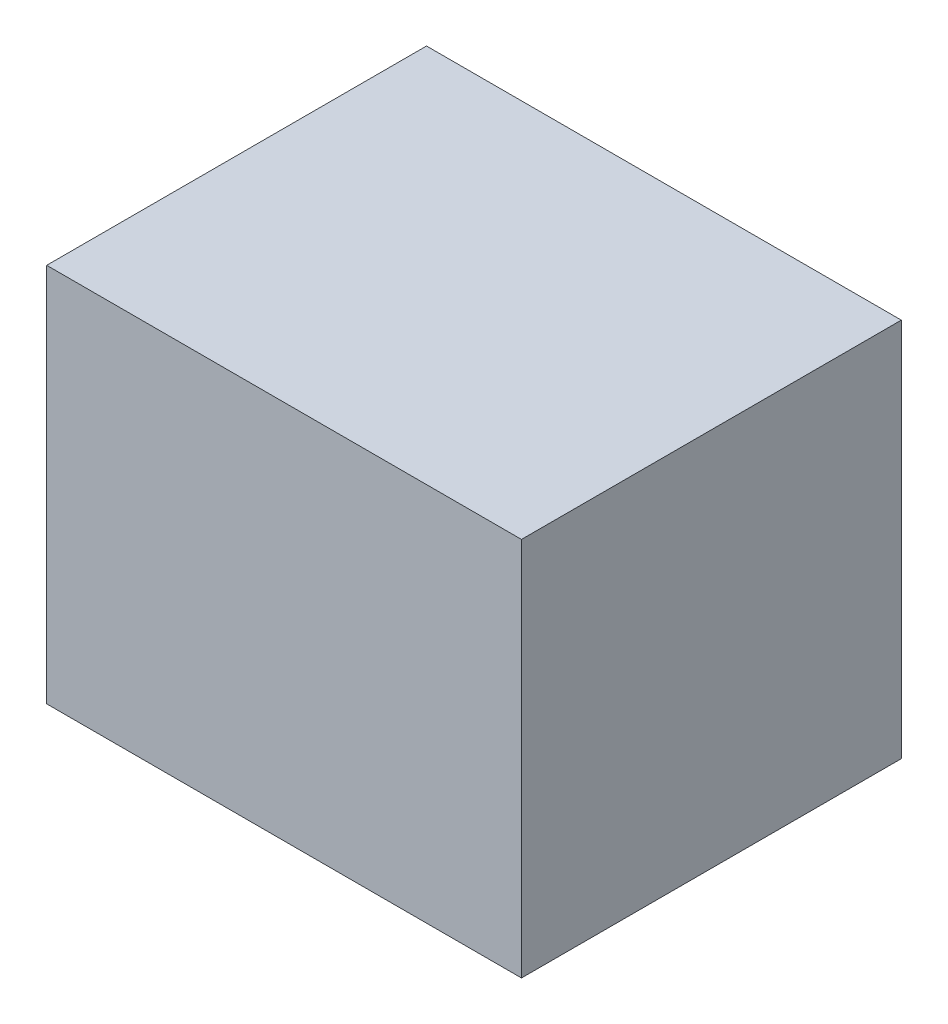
ISO-10303-21;
HEADER;
FILE_DESCRIPTION(('STEP AP214'),'2;1');
FILE_NAME('part.step','',(''),(''),'','','');
FILE_SCHEMA(('AUTOMOTIVE_DESIGN { 1 0 10303 214 1 1 1 1 }'));
ENDSEC;
DATA;
#1=APPLICATION_CONTEXT('core data for automotive mechanical design processes');
#2=APPLICATION_PROTOCOL_DEFINITION('international standard','automotive_design',2000,#1);
#3=PRODUCT_CONTEXT('',#1,'mechanical');
#4=PRODUCT('Part','Part','',(#3));
#5=PRODUCT_RELATED_PRODUCT_CATEGORY('part','',(#4));
#6=PRODUCT_DEFINITION_FORMATION('','',#4);
#7=PRODUCT_DEFINITION_CONTEXT('part definition',#1,'design');
#8=PRODUCT_DEFINITION('design','',#6,#7);
#9=PRODUCT_DEFINITION_SHAPE('','',#8);
#10=(LENGTH_UNIT() NAMED_UNIT(*) SI_UNIT(.MILLI.,.METRE.));
#11=(NAMED_UNIT(*) PLANE_ANGLE_UNIT() SI_UNIT($,.RADIAN.));
#12=(NAMED_UNIT(*) SI_UNIT($,.STERADIAN.) SOLID_ANGLE_UNIT());
#13=UNCERTAINTY_MEASURE_WITH_UNIT(LENGTH_MEASURE(1.E-05),#10,'distance_accuracy_value','');
#14=(GEOMETRIC_REPRESENTATION_CONTEXT(3) GLOBAL_UNCERTAINTY_ASSIGNED_CONTEXT((#13)) GLOBAL_UNIT_ASSIGNED_CONTEXT((#10,
#11,#12)) REPRESENTATION_CONTEXT('',''));
#15=CARTESIAN_POINT('',(0.,0.,0.));
#16=DIRECTION('',(0.,0.,1.));
#17=DIRECTION('',(1.,0.,0.));
#18=AXIS2_PLACEMENT_3D('',#15,#16,#17);
#19=CARTESIAN_POINT('',(-0.635,-0.508,0.));
#20=DIRECTION('',(0.,1.,0.));
#21=DIRECTION('',(0.,0.,1.));
#22=AXIS2_PLACEMENT_3D('',#19,#20,#21);
#23=PLANE('',#22);
#24=DIRECTION('',(0.,0.,1.));
#25=VECTOR('',#24,1.);
#26=CARTESIAN_POINT('',(0.635,-0.508,0.));
#27=LINE('',#26,#25);
#28=CARTESIAN_POINT('',(0.635,-0.508,0.));
#29=VERTEX_POINT('',#28);
#30=CARTESIAN_POINT('',(0.635,-0.508,1.016));
#31=VERTEX_POINT('',#30);
#32=EDGE_CURVE('E20',#29,#31,#27,.T.);
#33=ORIENTED_EDGE('',*,*,#32,.T.);
#34=DIRECTION('',(-1.,0.,0.));
#35=VECTOR('',#34,1.);
#36=CARTESIAN_POINT('',(0.635,-0.508,1.016));
#37=LINE('',#36,#35);
#38=CARTESIAN_POINT('',(-0.635,-0.508,1.016));
#39=VERTEX_POINT('',#38);
#40=EDGE_CURVE('E55',#31,#39,#37,.T.);
#41=ORIENTED_EDGE('',*,*,#40,.T.);
#42=DIRECTION('',(0.,0.,-1.));
#43=VECTOR('',#42,1.);
#44=CARTESIAN_POINT('',(-0.635,-0.508,0.));
#45=LINE('',#44,#43);
#46=CARTESIAN_POINT('',(-0.635,-0.508,0.));
#47=VERTEX_POINT('',#46);
#48=EDGE_CURVE('E74',#39,#47,#45,.T.);
#49=ORIENTED_EDGE('',*,*,#48,.T.);
#50=DIRECTION('',(-1.,0.,0.));
#51=VECTOR('',#50,1.);
#52=CARTESIAN_POINT('',(0.635,-0.508,0.));
#53=LINE('',#52,#51);
#54=EDGE_CURVE('E66',#29,#47,#53,.T.);
#55=ORIENTED_EDGE('',*,*,#54,.F.);
#56=EDGE_LOOP('',(#33,#41,#49,#55));
#57=FACE_BOUND('',#56,.T.);
#58=ADVANCED_FACE('F17',(#57),#23,.F.);
#59=CARTESIAN_POINT('',(0.635,-0.508,0.));
#60=DIRECTION('',(-1.,0.,0.));
#61=DIRECTION('',(0.,0.,1.));
#62=AXIS2_PLACEMENT_3D('',#59,#60,#61);
#63=PLANE('',#62);
#64=DIRECTION('',(0.,0.,-1.));
#65=VECTOR('',#64,1.);
#66=CARTESIAN_POINT('',(0.635,0.508,0.));
#67=LINE('',#66,#65);
#68=CARTESIAN_POINT('',(0.635,0.508,0.));
#69=VERTEX_POINT('',#68);
#70=CARTESIAN_POINT('',(0.635,0.508,1.016));
#71=VERTEX_POINT('',#70);
#72=EDGE_CURVE('E72',#69,#71,#67,.F.);
#73=ORIENTED_EDGE('',*,*,#72,.T.);
#74=DIRECTION('',(0.,1.,0.));
#75=VECTOR('',#74,1.);
#76=CARTESIAN_POINT('',(0.635,-0.508,1.016));
#77=LINE('',#76,#75);
#78=EDGE_CURVE('E62',#71,#31,#77,.F.);
#79=ORIENTED_EDGE('',*,*,#78,.T.);
#80=ORIENTED_EDGE('',*,*,#32,.F.);
#81=DIRECTION('',(0.,1.,0.));
#82=VECTOR('',#81,1.);
#83=CARTESIAN_POINT('',(0.635,-0.508,0.));
#84=LINE('',#83,#82);
#85=EDGE_CURVE('E80',#69,#29,#84,.F.);
#86=ORIENTED_EDGE('',*,*,#85,.F.);
#87=EDGE_LOOP('',(#73,#79,#80,#86));
#88=FACE_BOUND('',#87,.T.);
#89=ADVANCED_FACE('F71',(#88),#63,.F.);
#90=CARTESIAN_POINT('',(0.635,-0.508,1.016));
#91=DIRECTION('',(0.,0.,-1.));
#92=DIRECTION('',(-1.,0.,0.));
#93=AXIS2_PLACEMENT_3D('',#90,#91,#92);
#94=PLANE('',#93);
#95=DIRECTION('',(1.,0.,0.));
#96=VECTOR('',#95,1.);
#97=CARTESIAN_POINT('',(0.635,0.508,1.016));
#98=LINE('',#97,#96);
#99=CARTESIAN_POINT('',(-0.635,0.508,1.016));
#100=VERTEX_POINT('',#99);
#101=EDGE_CURVE('E83',#71,#100,#98,.F.);
#102=ORIENTED_EDGE('',*,*,#101,.T.);
#103=DIRECTION('',(0.,1.,0.));
#104=VECTOR('',#103,1.);
#105=CARTESIAN_POINT('',(-0.635,0.508,1.016));
#106=LINE('',#105,#104);
#107=EDGE_CURVE('E64',#100,#39,#106,.F.);
#108=ORIENTED_EDGE('',*,*,#107,.T.);
#109=ORIENTED_EDGE('',*,*,#40,.F.);
#110=ORIENTED_EDGE('',*,*,#78,.F.);
#111=EDGE_LOOP('',(#102,#108,#109,#110));
#112=FACE_BOUND('',#111,.T.);
#113=ADVANCED_FACE('F60',(#112),#94,.F.);
#114=CARTESIAN_POINT('',(-0.635,0.508,0.));
#115=DIRECTION('',(1.,0.,0.));
#116=DIRECTION('',(0.,0.,-1.));
#117=AXIS2_PLACEMENT_3D('',#114,#115,#116);
#118=PLANE('',#117);
#119=ORIENTED_EDGE('',*,*,#48,.F.);
#120=ORIENTED_EDGE('',*,*,#107,.F.);
#121=DIRECTION('',(0.,0.,-1.));
#122=VECTOR('',#121,1.);
#123=CARTESIAN_POINT('',(-0.635,0.508,0.));
#124=LINE('',#123,#122);
#125=CARTESIAN_POINT('',(-0.635,0.508,0.));
#126=VERTEX_POINT('',#125);
#127=EDGE_CURVE('E26',#100,#126,#124,.T.);
#128=ORIENTED_EDGE('',*,*,#127,.T.);
#129=DIRECTION('',(0.,1.,0.));
#130=VECTOR('',#129,1.);
#131=CARTESIAN_POINT('',(-0.635,-0.508,0.));
#132=LINE('',#131,#130);
#133=EDGE_CURVE('E34',#47,#126,#132,.T.);
#134=ORIENTED_EDGE('',*,*,#133,.F.);
#135=EDGE_LOOP('',(#119,#120,#128,#134));
#136=FACE_BOUND('',#135,.T.);
#137=ADVANCED_FACE('F88',(#136),#118,.F.);
#138=CARTESIAN_POINT('',(0.635,-0.508,0.));
#139=DIRECTION('',(0.,0.,-1.));
#140=DIRECTION('',(-1.,0.,0.));
#141=AXIS2_PLACEMENT_3D('',#138,#139,#140);
#142=PLANE('',#141);
#143=DIRECTION('',(1.,0.,0.));
#144=VECTOR('',#143,1.);
#145=CARTESIAN_POINT('',(0.635,0.508,0.));
#146=LINE('',#145,#144);
#147=EDGE_CURVE('E11',#126,#69,#146,.T.);
#148=ORIENTED_EDGE('',*,*,#147,.T.);
#149=ORIENTED_EDGE('',*,*,#85,.T.);
#150=ORIENTED_EDGE('',*,*,#54,.T.);
#151=ORIENTED_EDGE('',*,*,#133,.T.);
#152=EDGE_LOOP('',(#148,#149,#150,#151));
#153=FACE_BOUND('',#152,.T.);
#154=ADVANCED_FACE('F91',(#153),#142,.T.);
#155=CARTESIAN_POINT('',(0.635,0.508,0.));
#156=DIRECTION('',(0.,-1.,0.));
#157=DIRECTION('',(0.,0.,-1.));
#158=AXIS2_PLACEMENT_3D('',#155,#156,#157);
#159=PLANE('',#158);
#160=ORIENTED_EDGE('',*,*,#127,.F.);
#161=ORIENTED_EDGE('',*,*,#101,.F.);
#162=ORIENTED_EDGE('',*,*,#72,.F.);
#163=ORIENTED_EDGE('',*,*,#147,.F.);
#164=EDGE_LOOP('',(#160,#161,#162,#163));
#165=FACE_BOUND('',#164,.T.);
#166=ADVANCED_FACE('F90',(#165),#159,.F.);
#167=CLOSED_SHELL('',(#58,#89,#113,#137,#154,#166));
#168=MANIFOLD_SOLID_BREP('B1',#167);
#169=ADVANCED_BREP_SHAPE_REPRESENTATION('',(#18,#168),#14);
#170=SHAPE_DEFINITION_REPRESENTATION(#9,#169);
ENDSEC;
END-ISO-10303-21;
